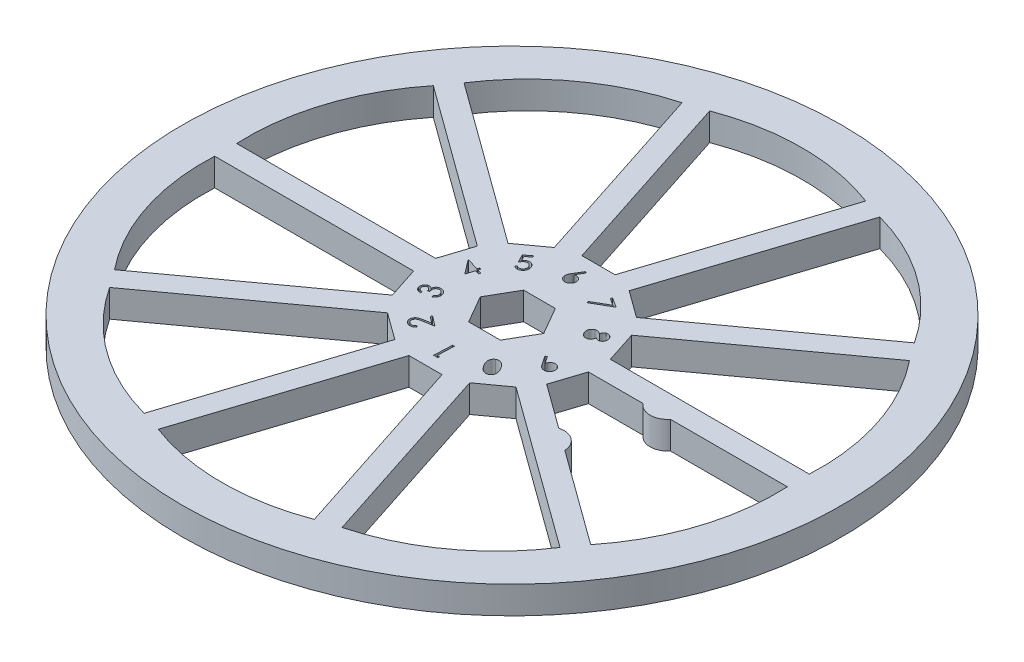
from build123d import *

# Parameters (mm, degrees)
SKETCH1_R           = 38.1
BOSS_EXTRUDE1_DEPTH = 3.175
CUT_EXTRUDE1_DEPTH  = 54.975
BOSS_EXTRUDE3_DEPTH = 3.175


with BuildPart() as part:
    # Sketch1 → Boss-Extrude1 (new body)
    with BuildSketch(Plane(origin=(0, 0, 0), x_dir=(1, 0, 0), z_dir=(0, 1, 0))):
        with Locations(Location((0, 0, 0), (0, 0, 270))):
            Circle(SKETCH1_R)
        with BuildLine():
            Line((-9.021230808, 31.874299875), (-1.913839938, 10))
            Line((-1.913839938, 10), (1.913839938, 10))
            Line((1.913839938, 10), (9.021230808, 31.874299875))
            ThreePointArc((9.021230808, 31.874299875), (0, 33.53030285), (-9.021230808, 31.874299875))
        make_face(mode=Mode.SUBTRACT)
        with BuildLine():
            Line((-4.329523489, 9.215096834), (-7.426181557, 6.965243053))
            Line((-7.426181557, 6.965243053), (-26.033572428, 20.484303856))
            ThreePointArc((-26.033572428, 20.484303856), (-19.70861752, 27.126584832), (-11.43691436, 31.089396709))
            Line((-11.43691436, 31.089396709), (-4.329523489, 9.215096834))
        make_face(mode=Mode.SUBTRACT)
        with BuildLine():
            Line((7.426181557, 6.965243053), (4.329523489, 9.215096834))
            Line((4.329523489, 9.215096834), (11.43691436, 31.089396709))
            ThreePointArc((11.43691436, 31.089396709), (19.70861752, 27.126584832), (26.033572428, 20.484303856))
            Line((26.033572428, 20.484303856), (7.426181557, 6.965243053))
        make_face(mode=Mode.SUBTRACT)
        with BuildLine():
            Line((-10.101974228, -1.27), (-8.919156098, -4.910339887))
            Line((-8.919156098, -4.910339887), (-27.526546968, -18.42940069))
            ThreePointArc((-27.526546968, -18.42940069), (-31.889213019, -10.361433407), (-33.101974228, -1.27))
            Line((-33.101974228, -1.27), (-10.101974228, -1.27))
        make_face(mode=Mode.SUBTRACT)
        with BuildLine():
            Line((8.919156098, -4.910339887), (10.101974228, -1.27))
            Line((10.101974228, -1.27), (33.101974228, -1.27))
            ThreePointArc((33.101974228, -1.27), (31.889213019, -10.361433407), (27.526546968, -18.42940069))
            Line((27.526546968, -18.42940069), (8.919156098, -4.910339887))
        make_face(mode=Mode.SUBTRACT)
        with BuildLine():
            Line((-1.913839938, -10), (1.913839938, -10))
            Line((1.913839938, -10), (9.021230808, -31.874299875))
            ThreePointArc((9.021230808, -31.874299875), (0, -33.53030285), (-9.021230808, -31.874299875))
            Line((-9.021230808, -31.874299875), (-1.913839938, -10))
        make_face(mode=Mode.SUBTRACT)
        with BuildLine():
            Line((-27.526546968, 18.42940069), (-8.919156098, 4.910339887))
            Line((-8.919156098, 4.910339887), (-10.101974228, 1.27))
            Line((-10.101974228, 1.27), (-33.101974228, 1.27))
            ThreePointArc((-33.101974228, 1.27), (-31.889213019, 10.361433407), (-27.526546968, 18.42940069))
        make_face(mode=Mode.SUBTRACT)
        with BuildLine():
            Line((-4.329523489, -9.215096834), (-7.426181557, -6.965243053))
            Line((-7.426181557, -6.965243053), (-26.033572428, -20.484303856))
            ThreePointArc((-26.033572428, -20.484303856), (-19.70861752, -27.126584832), (-11.43691436, -31.089396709))
            Line((-11.43691436, -31.089396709), (-4.329523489, -9.215096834))
        make_face(mode=Mode.SUBTRACT)
        with BuildLine():
            Line((8.919156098, 4.910339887), (10.101974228, 1.27))
            Line((10.101974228, 1.27), (33.101974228, 1.27))
            ThreePointArc((33.101974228, 1.27), (31.889213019, 10.361433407), (27.526546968, 18.42940069))
            Line((27.526546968, 18.42940069), (8.919156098, 4.910339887))
        make_face(mode=Mode.SUBTRACT)
        with BuildLine():
            Line((7.426181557, -6.965243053), (4.329523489, -9.215096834))
            Line((4.329523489, -9.215096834), (11.43691436, -31.089396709))
            ThreePointArc((11.43691436, -31.089396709), (19.70861752, -27.126584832), (26.033572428, -20.484303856))
            Line((26.033572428, -20.484303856), (7.426181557, -6.965243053))
        make_face(mode=Mode.SUBTRACT)
        Polygon((3.666174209, 0), (1.833087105, 3.175), (-1.833087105, 3.175), (-3.666174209, 0), (-1.833087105, -3.175), (1.833087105, -3.175), align=None, mode=Mode.SUBTRACT)
    extrude(amount=BOSS_EXTRUDE1_DEPTH)

    # Sketch4 → Cut-Extrude1 (cut, through all)
    # profile 1 of 10: a face of its own
    with BuildSketch(Plane(origin=(0, 3.175, 0), x_dir=(1, 0, 0), z_dir=(0, 1, 0))):
        with BuildLine():
            Line((6.008134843, -2.207274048), (6.177739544, -2.089822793))
            Line((6.177739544, -2.089822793), (6.758211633, -2.944630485))
            add(Edge.make_bspline(
                [(6.758211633, -2.944630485), (6.759998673, -2.925079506), (6.763474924, -2.887047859), (6.774121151, -2.832025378), (6.787033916, -2.780153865), (6.79957908, -2.747641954), (6.805700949, -2.731776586)],
                knots=[0, 0, 0, 0, 1.075315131, 2.091762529, 3.068806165, 4, 4, 4, 4], degree=3))
            add(Edge.make_bspline(
                [(6.805700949, -2.731776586), (6.814114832, -2.712946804), (6.830622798, -2.676002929), (6.861067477, -2.624206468), (6.895968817, -2.576829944), (6.93547794, -2.534024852), (6.979105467, -2.495536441), (7.026933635, -2.461337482), (7.079339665, -2.431783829), (7.135292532, -2.406331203), (7.193818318, -2.386944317), (7.25294362, -2.371809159), (7.312752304, -2.364676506), (7.37280331, -2.362097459), (7.433253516, -2.366845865), (7.494165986, -2.376191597), (7.555058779, -2.393146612), (7.594897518, -2.408226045), (7.615139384, -2.41588783)],
                knots=[0, 0, 0, 0, 1.022013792, 2.005182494, 2.97231041, 3.934474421, 4.887767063, 5.852327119, 6.844124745, 7.866642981, 8.894932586, 9.89776092, 10.886955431, 11.875703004, 12.873302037, 13.888324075, 14.92706791, 16, 16, 16, 16], degree=3))
            add(Edge.make_bspline(
                [(7.615139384, -2.41588783), (7.642252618, -2.427997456), (7.69550017, -2.451779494), (7.767460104, -2.499863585), (7.831918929, -2.554778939), (7.887467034, -2.617883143), (7.9344972, -2.68733619), (7.970479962, -2.763279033), (7.997382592, -2.844220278), (8.01225277, -2.929759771), (8.018329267, -3.017010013), (8.011970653, -3.103897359), (7.99559219, -3.18956788), (7.975215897, -3.244078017), (7.96494908, -3.271543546)],
                knots=[0, 0, 0, 0, 1.036517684, 2.035612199, 3.013201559, 3.989841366, 4.965618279, 5.935849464, 6.918719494, 7.938327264, 8.963189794, 9.968654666, 10.976484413, 12, 12, 12, 12], degree=3))
            add(Edge.make_bspline(
                [(7.96494908, -3.271543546), (7.953007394, -3.297601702), (7.929392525, -3.349132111), (7.883005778, -3.42015218), (7.827837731, -3.483771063), (7.764704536, -3.539697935), (7.695005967, -3.58667744), (7.619724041, -3.623714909), (7.539702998, -3.650143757), (7.455893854, -3.665037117), (7.370871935, -3.669755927), (7.286493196, -3.663939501), (7.203629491, -3.64695365), (7.150782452, -3.627680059), (7.124133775, -3.617961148)],
                knots=[0, 0, 0, 0, 1.01839986, 2.013901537, 3.004594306, 4.005222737, 5.004853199, 5.985019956, 6.980115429, 7.991731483, 9.003622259, 10.001405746, 10.99218778, 12, 12, 12, 12], degree=3))
            add(Edge.make_bspline(
                [(7.124133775, -3.617961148), (7.103996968, -3.609044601), (7.063097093, -3.590934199), (7.004458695, -3.55542633), (6.946830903, -3.513795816), (6.889198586, -3.464959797), (6.831284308, -3.406042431), (6.771386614, -3.335849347), (6.708385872, -3.253625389), (6.667446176, -3.193463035), (6.645848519, -3.161724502)],
                knots=[0, 0, 0, 0, 0.787036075, 1.59854923, 2.445988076, 3.328266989, 4.297018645, 5.397528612, 6.627071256, 8, 8, 8, 8], degree=3))
            Line((6.645848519, -3.161724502), (6.008134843, -2.207274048))
        make_face()
        with BuildLine():
            add(Edge.make_bspline(
                [(6.95834518, -2.847107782), (6.952989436, -2.861294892), (6.942472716, -2.889153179), (6.931447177, -2.932053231), (6.924479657, -2.974773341), (6.922503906, -3.017701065), (6.924432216, -3.060493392), (6.931469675, -3.103213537), (6.942557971, -3.145787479), (6.957709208, -3.187807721), (6.976574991, -3.22836067), (6.99915169, -3.265942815), (7.024219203, -3.300999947), (7.053299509, -3.332077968), (7.084809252, -3.360938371), (7.119674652, -3.386315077), (7.1576361, -3.408574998), (7.184642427, -3.420622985), (7.198335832, -3.426731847)],
                knots=[0, 0, 0, 0, 1.04241003, 2.04691155, 3.041056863, 4.014450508, 4.997553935, 5.98209837, 6.98659989, 8.019857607, 9.050596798, 10.057635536, 11.031854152, 12.008882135, 12.979358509, 13.967161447, 14.969260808, 16, 16, 16, 16], degree=3))
            add(Edge.make_bspline(
                [(7.198335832, -3.426731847), (7.212380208, -3.432084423), (7.240078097, -3.442640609), (7.282683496, -3.453715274), (7.325332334, -3.460060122), (7.367935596, -3.462185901), (7.410590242, -3.460186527), (7.453169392, -3.453186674), (7.495742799, -3.442093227), (7.537766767, -3.42694772), (7.578305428, -3.408064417), (7.616108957, -3.385448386), (7.651210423, -3.359957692), (7.683006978, -3.331063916), (7.711642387, -3.299131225), (7.736716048, -3.263819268), (7.759464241, -3.2258657), (7.771465, -3.198476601), (7.777535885, -3.184621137)],
                knots=[0, 0, 0, 0, 1.032325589, 2.035920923, 3.01808944, 3.990604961, 4.963120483, 5.946776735, 6.950372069, 7.982697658, 9.012506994, 10.018637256, 11.005549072, 11.988869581, 12.965692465, 13.946899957, 14.96138774, 16, 16, 16, 16], degree=3))
            add(Edge.make_bspline(
                [(7.777535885, -3.184621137), (7.782888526, -3.170576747), (7.793444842, -3.142878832), (7.804518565, -3.100273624), (7.810866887, -3.057624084), (7.81297986, -3.015023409), (7.811034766, -2.972498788), (7.803901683, -2.930091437), (7.793020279, -2.887543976), (7.777216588, -2.84570235), (7.758450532, -2.805086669), (7.73598684, -2.767285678), (7.710138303, -2.73274507), (7.682067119, -2.700591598), (7.649609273, -2.672704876), (7.614988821, -2.647052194), (7.576958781, -2.624864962), (7.549961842, -2.612807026), (7.536273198, -2.606693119)],
                knots=[0, 0, 0, 0, 1.035134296, 2.041460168, 3.026300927, 4.001462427, 4.976623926, 5.953340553, 6.959666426, 7.998140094, 9.030751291, 10.039618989, 11.021372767, 12.000853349, 12.97387249, 13.963469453, 14.967388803, 16, 16, 16, 16], degree=3))
            add(Edge.make_bspline(
                [(7.536273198, -2.606693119), (7.522228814, -2.601340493), (7.494530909, -2.590784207), (7.451925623, -2.579710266), (7.40927637, -2.573362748), (7.366674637, -2.571246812), (7.324153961, -2.573202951), (7.281731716, -2.580294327), (7.239289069, -2.591325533), (7.197267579, -2.606480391), (7.156723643, -2.625354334), (7.119107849, -2.647895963), (7.084249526, -2.673035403), (7.05270375, -2.701635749), (7.024303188, -2.733592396), (6.998734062, -2.768420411), (6.976509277, -2.806414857), (6.964456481, -2.833416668), (6.95834518, -2.847107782)],
                knots=[0, 0, 0, 0, 1.035774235, 2.042722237, 3.028171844, 4.003936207, 4.97970057, 5.957021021, 6.963969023, 7.999743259, 9.032992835, 10.042484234, 11.019075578, 11.991915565, 12.972001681, 13.962210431, 14.966750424, 16, 16, 16, 16], degree=3))
        make_face(mode=Mode.SUBTRACT)
    # profile 2 of 10: a face of its own
    with BuildSketch(Plane(origin=(0, 3.175, 0), x_dir=(1, 0, 0), z_dir=(0, 1, 0))):
        with BuildLine():
            add(Edge.make_bspline(
                [(4.646652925, -5.931807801), (4.664653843, -5.960382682), (4.699634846, -6.015911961), (4.747354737, -6.098619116), (4.790166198, -6.177405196), (4.826609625, -6.253248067), (4.858252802, -6.325337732), (4.883533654, -6.394290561), (4.904552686, -6.459292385), (4.918854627, -6.521510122), (4.928559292, -6.581183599), (4.935235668, -6.638614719), (4.93732577, -6.694605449), (4.935504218, -6.74883383), (4.930801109, -6.801640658), (4.921102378, -6.85256161), (4.908739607, -6.902089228), (4.891437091, -6.949348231), (4.871669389, -6.994993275), (4.848359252, -7.037995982), (4.822277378, -7.078671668), (4.793328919, -7.117034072), (4.761282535, -7.153082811), (4.725658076, -7.186019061), (4.688011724, -7.2175363), (4.660548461, -7.235754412), (4.646652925, -7.244972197)],
                knots=[0, 0, 0, 0, 1.645831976, 3.198328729, 4.653025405, 6.014789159, 7.298288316, 8.488304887, 9.592894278, 10.625525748, 11.596046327, 12.538562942, 13.441613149, 14.323771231, 15.181935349, 16.02233202, 16.84768784, 17.666926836, 18.471967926, 19.270231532, 20.04793037, 20.824957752, 21.610397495, 22.394990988, 23.187916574, 24, 24, 24, 24], degree=3))
            add(Edge.make_bspline(
                [(4.646652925, -7.244972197), (4.632210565, -7.253659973), (4.603571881, -7.270887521), (4.558936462, -7.292877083), (4.513552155, -7.31141686), (4.46682123, -7.325096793), (4.419388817, -7.336574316), (4.370656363, -7.343114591), (4.321058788, -7.345990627), (4.270734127, -7.345775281), (4.219812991, -7.341051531), (4.168660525, -7.331997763), (4.117234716, -7.318998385), (4.065880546, -7.300751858), (4.014072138, -7.279250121), (3.96212162, -7.253337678), (3.910543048, -7.222396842), (3.858035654, -7.188211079), (3.805463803, -7.14844253), (3.753195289, -7.102535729), (3.700437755, -7.051113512), (3.647904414, -6.993565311), (3.594917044, -6.93028461), (3.541542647, -6.861156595), (3.488038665, -6.78607171), (3.453708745, -6.733182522), (3.436099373, -6.70605326)],
                knots=[0, 0, 0, 0, 0.815853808, 1.617808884, 2.407075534, 3.186547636, 3.973496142, 4.768174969, 5.563560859, 6.378064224, 7.202826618, 8.036627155, 8.8915378, 9.768172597, 10.673203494, 11.606770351, 12.576348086, 13.584347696, 14.639750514, 15.765220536, 16.951028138, 18.2056322, 19.536778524, 20.946858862, 22.433905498, 24, 24, 24, 24], degree=3))
            add(Edge.make_bspline(
                [(3.436099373, -6.70605326), (3.418942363, -6.678753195), (3.385580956, -6.625668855), (3.340039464, -6.546033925), (3.299818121, -6.469043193), (3.264567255, -6.394803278), (3.233984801, -6.323432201), (3.209598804, -6.254353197), (3.189676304, -6.188096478), (3.175613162, -6.124127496), (3.166580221, -6.062444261), (3.160134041, -6.002902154), (3.15878161, -5.94509298), (3.160059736, -5.889115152), (3.166132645, -5.834970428), (3.176008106, -5.782742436), (3.188897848, -5.73196885), (3.20648032, -5.683324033), (3.227187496, -5.636704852), (3.250926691, -5.592663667), (3.27741237, -5.551018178), (3.307112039, -5.512065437), (3.339870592, -5.475496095), (3.375483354, -5.441471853), (3.414374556, -5.410343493), (3.442041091, -5.391709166), (3.456027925, -5.38228857)],
                knots=[0, 0, 0, 0, 1.562310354, 3.03787612, 4.44395277, 5.770467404, 7.019601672, 8.204525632, 9.318421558, 10.370311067, 11.374754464, 12.338370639, 13.270212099, 14.174670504, 15.049738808, 15.906744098, 16.748953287, 17.585125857, 18.409860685, 19.218832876, 20.007279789, 20.799021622, 21.589607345, 22.384069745, 23.183065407, 24, 24, 24, 24], degree=3))
            add(Edge.make_bspline(
                [(3.456027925, -5.38228857), (3.470162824, -5.373559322), (3.498234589, -5.356223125), (3.542375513, -5.334858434), (3.587289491, -5.316873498), (3.632845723, -5.302304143), (3.679602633, -5.292260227), (3.727050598, -5.285345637), (3.775552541, -5.282429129), (3.824739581, -5.283313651), (3.874519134, -5.287940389), (3.924474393, -5.296773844), (3.974358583, -5.310326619), (4.024511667, -5.32689591), (4.074164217, -5.349154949), (4.124478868, -5.374302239), (4.174255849, -5.404791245), (4.224911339, -5.43875031), (4.275625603, -5.478577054), (4.326757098, -5.524445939), (4.37876556, -5.57648179), (4.43112742, -5.635168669), (4.484587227, -5.699994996), (4.538287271, -5.771525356), (4.593131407, -5.848985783), (4.628480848, -5.903687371), (4.646652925, -5.931807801)],
                knots=[0, 0, 0, 0, 0.810485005, 1.609614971, 2.389818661, 3.17096737, 3.9409775, 4.72151665, 5.509490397, 6.3098999, 7.120649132, 7.947529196, 8.782571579, 9.642161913, 10.522704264, 11.435989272, 12.386082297, 13.369627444, 14.411590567, 15.530535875, 16.720858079, 18.000814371, 19.368238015, 20.821189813, 22.365869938, 24, 24, 24, 24], degree=3))
        make_face()
        with BuildLine():
            add(Edge.make_bspline(
                [(4.477048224, -6.03569068), (4.461336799, -6.011584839), (4.430874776, -5.964847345), (4.384673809, -5.898223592), (4.339654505, -5.837300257), (4.296712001, -5.781252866), (4.253866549, -5.731915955), (4.212529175, -5.687959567), (4.172992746, -5.649190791), (4.122303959, -5.606353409), (4.059293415, -5.562604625), (3.982412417, -5.521661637), (3.904429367, -5.494758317), (3.826538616, -5.482243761), (3.751238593, -5.481369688), (3.679737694, -5.490796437), (3.612804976, -5.511945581), (3.572716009, -5.534631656), (3.552702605, -5.545957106)],
                knots=[0, 0, 0, 0, 1.181714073, 2.291160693, 3.329086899, 4.292828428, 5.190029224, 6.011310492, 6.770753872, 7.462710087, 8.734792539, 9.913537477, 11.029615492, 12.106059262, 13.139365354, 14.112154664, 15.057540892, 16, 16, 16, 16], degree=3))
            add(Edge.make_bspline(
                [(3.552702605, -5.545957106), (3.533742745, -5.559266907), (3.495894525, -5.585836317), (3.449291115, -5.638313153), (3.409655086, -5.697727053), (3.3845157, -5.753620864), (3.369314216, -5.801765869), (3.360967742, -5.839948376), (3.355245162, -5.879484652), (3.353557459, -5.920474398), (3.353474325, -5.96287331), (3.35839661, -6.006697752), (3.36469003, -6.052122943), (3.371826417, -6.082519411), (3.375465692, -6.098020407)],
                knots=[0, 0, 0, 0, 1.339326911, 2.673603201, 4.03984646, 5.470463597, 6.209276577, 6.964946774, 7.734622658, 8.522543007, 9.342223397, 10.190421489, 11.077186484, 12, 12, 12, 12], degree=3))
            add(Edge.make_bspline(
                [(3.375465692, -6.098020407), (3.380323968, -6.117589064), (3.390191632, -6.157335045), (3.409612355, -6.216842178), (3.432615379, -6.277443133), (3.458868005, -6.339282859), (3.488677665, -6.402245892), (3.522143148, -6.466212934), (3.559602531, -6.531121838), (3.586495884, -6.574263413), (3.600191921, -6.596234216)],
                knots=[0, 0, 0, 0, 0.881068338, 1.78954166, 2.733856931, 3.713774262, 4.725199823, 5.77800347, 6.868398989, 8, 8, 8, 8], degree=3))
            add(Edge.make_bspline(
                [(3.600191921, -6.596234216), (3.614348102, -6.617938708), (3.64197834, -6.660301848), (3.684447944, -6.721027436), (3.726719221, -6.777700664), (3.769667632, -6.829461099), (3.811504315, -6.877946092), (3.854128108, -6.921512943), (3.896182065, -6.961411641), (3.938483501, -6.996813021), (3.980402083, -7.028214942), (4.021929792, -7.05574057), (4.062824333, -7.079839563), (4.103521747, -7.099803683), (4.14398596, -7.115877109), (4.183669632, -7.128911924), (4.223215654, -7.13732462), (4.274252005, -7.144086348), (4.336254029, -7.144204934), (4.407123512, -7.134105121), (4.473771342, -7.113837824), (4.513310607, -7.090993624), (4.533017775, -7.079607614)],
                knots=[0, 0, 0, 0, 1.330078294, 2.596065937, 3.80331419, 4.957991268, 6.047946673, 7.089475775, 8.085195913, 9.022479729, 9.919210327, 10.772385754, 11.578713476, 12.354194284, 13.096521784, 13.81239025, 14.49544863, 15.168571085, 16.45274294, 17.662430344, 18.834908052, 20, 20, 20, 20], degree=3))
            add(Edge.make_bspline(
                [(4.533017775, -7.079607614), (4.551939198, -7.066264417), (4.589789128, -7.039573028), (4.637042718, -6.987472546), (4.67612162, -6.927149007), (4.70103527, -6.870696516), (4.716800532, -6.822117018), (4.725744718, -6.78368549), (4.731007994, -6.74378164), (4.734255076, -6.702717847), (4.733538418, -6.660196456), (4.730294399, -6.616254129), (4.723186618, -6.571169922), (4.713968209, -6.524204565), (4.700519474, -6.474910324), (4.68273882, -6.422299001), (4.659460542, -6.366514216), (4.632391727, -6.307004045), (4.60027979, -6.244212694), (4.563955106, -6.177582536), (4.522113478, -6.107775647), (4.492391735, -6.060233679), (4.477048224, -6.03569068)],
                knots=[0, 0, 0, 0, 1.185349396, 2.371142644, 3.582401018, 4.861775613, 5.524760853, 6.202231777, 6.88342084, 7.58889689, 8.314341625, 9.063762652, 9.848579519, 10.655219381, 11.519217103, 12.46892058, 13.503486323, 14.620144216, 15.823732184, 17.122294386, 18.514417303, 20, 20, 20, 20], degree=3))
        make_face(mode=Mode.SUBTRACT)
    # profile 3 of 10: a face of its own
    with BuildSketch(Plane(origin=(0, 3.175, 0), x_dir=(1, 0, 0), z_dir=(0, 1, 0))):
        Polygon((-0.096389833, -8.560304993), (-0.510225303, -8.542920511), (-0.421606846, -6.437702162), (-0.212569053, -6.446606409), (-0.292283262, -8.345755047), (0.038445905, -8.359747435), align=None)
    # profile 4 of 10: a face of its own
    with BuildSketch(Plane(origin=(0, 3.175, 0), x_dir=(1, 0, 0), z_dir=(0, 1, 0))):
        with BuildLine():
            Line((-4.432784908, -6.555224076), (-4.272084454, -6.678611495))
            add(Edge.make_bspline(
                [(-4.272084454, -6.678611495), (-4.288747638, -6.698101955), (-4.32139403, -6.736287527), (-4.374584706, -6.788037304), (-4.430999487, -6.832573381), (-4.489513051, -6.871705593), (-4.551289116, -6.903333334), (-4.615371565, -6.929164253), (-4.682189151, -6.948162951), (-4.750905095, -6.960833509), (-4.820208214, -6.966758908), (-4.888667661, -6.965995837), (-4.955750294, -6.958369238), (-5.021160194, -6.943747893), (-5.085314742, -6.923145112), (-5.147303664, -6.894517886), (-5.208611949, -6.86039639), (-5.246882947, -6.832388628), (-5.266392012, -6.818111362)],
                knots=[0, 0, 0, 0, 1.100149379, 2.155404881, 3.178494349, 4.181169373, 5.171382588, 6.151324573, 7.141983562, 8.147297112, 9.145688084, 10.122339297, 11.080890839, 12.037502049, 12.994670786, 13.966544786, 14.963423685, 16, 16, 16, 16], degree=3))
            add(Edge.make_bspline(
                [(-5.266392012, -6.818111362), (-5.284896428, -6.803157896), (-5.321055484, -6.773937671), (-5.36973623, -6.725642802), (-5.41205071, -6.674813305), (-5.447107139, -6.620795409), (-5.477525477, -6.565190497), (-5.5001583, -6.506349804), (-5.517019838, -6.44515282), (-5.526781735, -6.381980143), (-5.531141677, -6.318543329), (-5.52931742, -6.256102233), (-5.5223844, -6.195408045), (-5.508956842, -6.136542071), (-5.490389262, -6.079329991), (-5.465435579, -6.02412847), (-5.435477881, -5.970182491), (-5.411061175, -5.936636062), (-5.398683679, -5.919630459)],
                knots=[0, 0, 0, 0, 1.125548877, 2.199409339, 3.240166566, 4.24957425, 5.243251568, 6.234651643, 7.22627742, 8.242556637, 9.254974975, 10.232096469, 11.195517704, 12.141759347, 13.085324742, 14.03767207, 15.005242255, 16, 16, 16, 16], degree=3))
            add(Edge.make_bspline(
                [(-5.398683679, -5.919630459), (-5.379898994, -5.89676072), (-5.342666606, -5.851431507), (-5.276831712, -5.79317008), (-5.204684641, -5.743522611), (-5.138403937, -5.709613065), (-5.079785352, -5.686256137), (-5.029446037, -5.668512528), (-4.972972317, -5.651252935), (-4.910475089, -5.634266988), (-4.841680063, -5.617935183), (-4.766795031, -5.601372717), (-4.685785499, -5.585283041), (-4.629687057, -5.575368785), (-4.600693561, -5.570244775)],
                knots=[0, 0, 0, 0, 1.19032024, 2.359287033, 3.526020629, 4.709749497, 5.348159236, 6.06644772, 6.858627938, 7.725764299, 8.674200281, 9.705837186, 10.814302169, 12, 12, 12, 12], degree=3))
            Line((-4.600693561, -5.570244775), (-3.838320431, -5.440497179))
            Line((-3.838320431, -5.440497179), (-4.612141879, -4.846880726))
            Line((-4.612141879, -4.846880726), (-4.487906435, -4.684908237))
            Line((-4.487906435, -4.684908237), (-3.349434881, -5.558372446))
            Line((-3.349434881, -5.558372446), (-4.520131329, -5.758930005))
            add(Edge.make_bspline(
                [(-4.520131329, -5.758930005), (-4.54854643, -5.763840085), (-4.603295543, -5.773300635), (-4.681952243, -5.787498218), (-4.753765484, -5.801920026), (-4.818661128, -5.816297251), (-4.876698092, -5.830478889), (-4.927777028, -5.845129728), (-4.972237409, -5.85869336), (-5.021781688, -5.877197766), (-5.076562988, -5.903509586), (-5.135683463, -5.942107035), (-5.188994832, -5.987325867), (-5.218547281, -6.023044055), (-5.233319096, -6.04089782)],
                knots=[0, 0, 0, 0, 1.320310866, 2.543923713, 3.659492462, 4.673759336, 5.587226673, 6.394355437, 7.106613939, 7.714816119, 8.814657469, 9.880838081, 10.940735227, 12, 12, 12, 12], degree=3))
            add(Edge.make_bspline(
                [(-5.233319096, -6.04089782), (-5.24191783, -6.052743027), (-5.258886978, -6.076118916), (-5.279576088, -6.113751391), (-5.296491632, -6.152399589), (-5.30798111, -6.19271991), (-5.316947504, -6.23386884), (-5.320508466, -6.276718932), (-5.320067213, -6.320719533), (-5.315427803, -6.365447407), (-5.306532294, -6.409713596), (-5.293858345, -6.452610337), (-5.277385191, -6.493450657), (-5.256611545, -6.53213664), (-5.232226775, -6.568919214), (-5.203475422, -6.603398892), (-5.171065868, -6.636025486), (-5.146876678, -6.655514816), (-5.134524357, -6.665467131)],
                knots=[0, 0, 0, 0, 0.998093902, 1.969685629, 2.92471149, 3.87082952, 4.826196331, 5.794718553, 6.797973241, 7.825964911, 8.85887793, 9.875217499, 10.874755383, 11.858671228, 12.867290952, 13.881293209, 14.918072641, 16, 16, 16, 16], degree=3))
            add(Edge.make_bspline(
                [(-5.134524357, -6.665467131), (-5.121107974, -6.675161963), (-5.094698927, -6.694245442), (-5.053115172, -6.718546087), (-5.010432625, -6.73776632), (-4.966903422, -6.75212129), (-4.922690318, -6.76268893), (-4.877420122, -6.76741431), (-4.831406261, -6.768583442), (-4.784821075, -6.764074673), (-4.73803111, -6.755305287), (-4.691880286, -6.741237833), (-4.646557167, -6.722265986), (-4.601867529, -6.698948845), (-4.558038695, -6.670349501), (-4.515307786, -6.636456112), (-4.47258305, -6.598563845), (-4.44624936, -6.569886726), (-4.432784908, -6.555224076)],
                knots=[0, 0, 0, 0, 1.00430334, 1.976888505, 2.917624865, 3.839993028, 4.755634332, 5.670793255, 6.597460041, 7.54501695, 8.505725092, 9.482726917, 10.467307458, 11.484173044, 12.538281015, 13.638306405, 14.792462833, 16, 16, 16, 16], degree=3))
        make_face()
    # profile 5 of 10: a face of its own
    with BuildSketch(Plane(origin=(0, 3.175, 0), x_dir=(1, 0, 0), z_dir=(0, 1, 0))):
        with BuildLine():
            Line((-7.565496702, -2.829563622), (-7.501046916, -3.034361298))
            add(Edge.make_bspline(
                [(-7.501046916, -3.034361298), (-7.522803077, -3.035798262), (-7.565300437, -3.038605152), (-7.628067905, -3.03757569), (-7.688355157, -3.032805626), (-7.745989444, -3.022842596), (-7.801252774, -3.009392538), (-7.853891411, -2.991307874), (-7.903674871, -2.967944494), (-7.951144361, -2.9415616), (-7.99528649, -2.910998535), (-8.035671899, -2.876848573), (-8.072717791, -2.839848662), (-8.106327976, -2.799938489), (-8.136296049, -2.756865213), (-8.161942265, -2.710366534), (-8.184891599, -2.661079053), (-8.196478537, -2.626309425), (-8.202362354, -2.608653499)],
                knots=[0, 0, 0, 0, 1.171238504, 2.287836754, 3.370199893, 4.417814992, 5.427291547, 6.424116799, 7.402837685, 8.378843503, 9.339569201, 10.28287391, 11.217361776, 12.149964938, 13.083310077, 14.032011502, 15.000660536, 16, 16, 16, 16], degree=3))
            add(Edge.make_bspline(
                [(-8.202362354, -2.608653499), (-8.209664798, -2.582652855), (-8.224142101, -2.531105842), (-8.23413508, -2.451641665), (-8.233967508, -2.372208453), (-8.224755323, -2.29361638), (-8.206374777, -2.21760588), (-8.178727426, -2.146289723), (-8.142316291, -2.080673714), (-8.097802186, -2.021474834), (-8.04692814, -1.969471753), (-7.990648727, -1.926352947), (-7.930693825, -1.890920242), (-7.887340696, -1.875568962), (-7.865697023, -1.867904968)],
                knots=[0, 0, 0, 0, 1.075905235, 2.133012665, 3.181428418, 4.237152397, 5.28162113, 6.291729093, 7.278286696, 8.264699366, 9.23724505, 10.169628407, 11.086202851, 12, 12, 12, 12], degree=3))
            add(Edge.make_bspline(
                [(-7.865697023, -1.867904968), (-7.844348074, -1.86189963), (-7.802444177, -1.850112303), (-7.738057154, -1.843513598), (-7.674676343, -1.846053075), (-7.612164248, -1.857698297), (-7.550478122, -1.878280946), (-7.489908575, -1.908495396), (-7.4301808, -1.947739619), (-7.393010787, -1.979551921), (-7.37384339, -1.995956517)],
                knots=[0, 0, 0, 0, 0.994688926, 1.952383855, 2.892751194, 3.835366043, 4.799018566, 5.804107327, 6.867647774, 8, 8, 8, 8], degree=3))
            add(Edge.make_bspline(
                [(-7.37384339, -1.995956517), (-7.370852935, -1.96940386), (-7.364961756, -1.917095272), (-7.344384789, -1.84154662), (-7.315929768, -1.769821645), (-7.289527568, -1.726104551), (-7.276320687, -1.704236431)],
                knots=[0, 0, 0, 0, 1.030676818, 2.03042766, 3.01478259, 4, 4, 4, 4], degree=3))
            add(Edge.make_bspline(
                [(-7.276320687, -1.704236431), (-7.266402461, -1.689627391), (-7.246729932, -1.66065076), (-7.213048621, -1.621061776), (-7.177397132, -1.584679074), (-7.139072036, -1.552304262), (-7.098083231, -1.523821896), (-7.054765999, -1.498709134), (-7.008826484, -1.477251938), (-6.976658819, -1.466352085), (-6.960431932, -1.460853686)],
                knots=[0, 0, 0, 0, 1.040428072, 2.063660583, 3.05951573, 4.04114841, 5.016713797, 5.99866477, 6.990432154, 8, 8, 8, 8], degree=3))
            add(Edge.make_bspline(
                [(-6.960431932, -1.460853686), (-6.931915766, -1.452902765), (-6.875020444, -1.437039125), (-6.786322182, -1.429060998), (-6.696394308, -1.431178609), (-6.621444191, -1.444052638), (-6.561839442, -1.459014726), (-6.518146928, -1.473369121), (-6.476073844, -1.490988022), (-6.4354331, -1.510696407), (-6.39649166, -1.533426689), (-6.359274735, -1.558845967), (-6.323412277, -1.587011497), (-6.277867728, -1.628129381), (-6.22556827, -1.685355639), (-6.171884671, -1.762298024), (-6.1270562, -1.847277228), (-6.105830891, -1.908427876), (-6.095023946, -1.939562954)],
                knots=[0, 0, 0, 0, 1.287151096, 2.568117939, 3.861540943, 5.196567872, 5.870010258, 6.537800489, 7.197510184, 7.855580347, 8.503930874, 9.159664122, 9.817359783, 10.488688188, 11.830921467, 13.183647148, 14.566043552, 16, 16, 16, 16], degree=3))
            add(Edge.make_bspline(
                [(-6.095023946, -1.939562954), (-6.088674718, -1.960803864), (-6.076183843, -2.002591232), (-6.064823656, -2.066015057), (-6.057478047, -2.127913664), (-6.056998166, -2.18880699), (-6.06076195, -2.248488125), (-6.071373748, -2.306878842), (-6.086464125, -2.364228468), (-6.10784562, -2.419893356), (-6.134045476, -2.474245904), (-6.166565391, -2.525817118), (-6.203934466, -2.575533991), (-6.247662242, -2.621960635), (-6.296054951, -2.666905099), (-6.350625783, -2.708695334), (-6.410598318, -2.748323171), (-6.453425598, -2.77204409), (-6.475362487, -2.784194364)],
                knots=[0, 0, 0, 0, 1.044301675, 2.054460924, 3.033078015, 3.979313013, 4.921150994, 5.847878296, 6.772375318, 7.712868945, 8.654518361, 9.612225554, 10.582368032, 11.581901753, 12.614575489, 13.692761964, 14.818191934, 16, 16, 16, 16], degree=3))
            Line((-6.475362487, -2.784194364), (-6.537268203, -2.587876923))
            add(Edge.make_bspline(
                [(-6.537268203, -2.587876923), (-6.522873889, -2.578581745), (-6.494821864, -2.560467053), (-6.456017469, -2.531244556), (-6.421114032, -2.501734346), (-6.389324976, -2.472646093), (-6.361927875, -2.442498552), (-6.337925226, -2.412323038), (-6.317655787, -2.381777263), (-6.3071027, -2.360440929), (-6.301941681, -2.35000633)],
                knots=[0, 0, 0, 0, 1.212756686, 2.36345273, 3.435782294, 4.448175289, 5.411358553, 6.316173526, 7.176519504, 8, 8, 8, 8], degree=3))
            add(Edge.make_bspline(
                [(-6.301941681, -2.35000633), (-6.296462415, -2.336670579), (-6.28555712, -2.310128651), (-6.273645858, -2.268667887), (-6.265995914, -2.226050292), (-6.26261346, -2.182297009), (-6.263633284, -2.13760073), (-6.268306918, -2.091924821), (-6.277127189, -2.045208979), (-6.286264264, -2.014261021), (-6.290917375, -1.998500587)],
                knots=[0, 0, 0, 0, 0.961111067, 1.912883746, 2.87075297, 3.844677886, 4.834712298, 5.848737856, 6.904456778, 8, 8, 8, 8], degree=3))
            add(Edge.make_bspline(
                [(-6.290917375, -1.998500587), (-6.297010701, -1.980873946), (-6.308933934, -1.946382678), (-6.33094473, -1.897432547), (-6.356588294, -1.852719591), (-6.385032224, -1.811670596), (-6.416862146, -1.774563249), (-6.45240474, -1.741729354), (-6.491009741, -1.712796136), (-6.532537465, -1.688372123), (-6.575540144, -1.668288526), (-6.618837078, -1.651918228), (-6.662438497, -1.640329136), (-6.706212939, -1.633522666), (-6.75013484, -1.631366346), (-6.794047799, -1.633956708), (-6.838079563, -1.641202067), (-6.866931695, -1.649265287), (-6.881565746, -1.653355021)],
                knots=[0, 0, 0, 0, 1.171811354, 2.29296428, 3.367246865, 4.407191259, 5.427563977, 6.433292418, 7.442428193, 8.454024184, 9.455427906, 10.422353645, 11.359649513, 12.285595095, 13.201644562, 14.118167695, 15.045518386, 16, 16, 16, 16], degree=3))
            add(Edge.make_bspline(
                [(-6.881565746, -1.653355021), (-6.900613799, -1.660284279), (-6.93855689, -1.674087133), (-6.99106043, -1.704852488), (-7.039036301, -1.742954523), (-7.081544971, -1.788225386), (-7.117905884, -1.838969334), (-7.147299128, -1.893988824), (-7.167372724, -1.953208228), (-7.178406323, -2.005141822), (-7.1823192, -2.049742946), (-7.18245454, -2.086854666), (-7.180835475, -2.127341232), (-7.17641199, -2.171197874), (-7.16958548, -2.218578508), (-7.160248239, -2.269356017), (-7.148150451, -2.323432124), (-7.139012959, -2.360482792), (-7.13427675, -2.379687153)],
                knots=[0, 0, 0, 0, 1.125656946, 2.242271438, 3.367021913, 4.523877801, 5.68462785, 6.831151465, 7.979910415, 9.151790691, 9.775346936, 10.467275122, 11.214856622, 12.028482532, 12.918001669, 13.877203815, 14.899697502, 16, 16, 16, 16], degree=3))
            Line((-7.13427675, -2.379687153), (-7.318297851, -2.437776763))
            add(Edge.make_bspline(
                [(-7.318297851, -2.437776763), (-7.325865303, -2.415390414), (-7.34072771, -2.371423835), (-7.370986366, -2.309937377), (-7.405148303, -2.252846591), (-7.444867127, -2.20226408), (-7.48675449, -2.157952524), (-7.529923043, -2.121084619), (-7.574943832, -2.094155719), (-7.620407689, -2.075384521), (-7.666229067, -2.065353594), (-7.711743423, -2.061881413), (-7.757239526, -2.064874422), (-7.786503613, -2.072899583), (-7.801247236, -2.076942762)],
                knots=[0, 0, 0, 0, 1.267118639, 2.488609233, 3.669981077, 4.832371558, 5.932386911, 6.939653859, 7.868597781, 8.736393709, 9.568297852, 10.374733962, 11.181170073, 12, 12, 12, 12], degree=3))
            add(Edge.make_bspline(
                [(-7.801247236, -2.076942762), (-7.811932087, -2.08068524), (-7.832883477, -2.08802368), (-7.862707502, -2.102681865), (-7.890053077, -2.120627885), (-7.915992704, -2.140848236), (-7.938630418, -2.165117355), (-7.960206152, -2.191223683), (-7.978699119, -2.220987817), (-7.995565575, -2.252740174), (-8.009700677, -2.286571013), (-8.01966591, -2.321781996), (-8.026558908, -2.357535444), (-8.029930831, -2.394021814), (-8.030034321, -2.431377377), (-8.025970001, -2.469514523), (-8.018947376, -2.508470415), (-8.011247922, -2.534091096), (-8.007316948, -2.547171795)],
                knots=[0, 0, 0, 0, 0.950376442, 1.86354576, 2.782254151, 3.694419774, 4.617947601, 5.563492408, 6.534987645, 7.5545434, 8.581879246, 9.607567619, 10.622690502, 11.636215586, 12.680895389, 13.754646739, 14.853629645, 16, 16, 16, 16], degree=3))
            add(Edge.make_bspline(
                [(-8.007316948, -2.547171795), (-7.999961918, -2.567841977), (-7.985578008, -2.608265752), (-7.952481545, -2.66253734), (-7.912692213, -2.710201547), (-7.872662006, -2.743268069), (-7.836695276, -2.765872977), (-7.80639416, -2.78069475), (-7.773105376, -2.793306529), (-7.737099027, -2.804242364), (-7.698304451, -2.813564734), (-7.656712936, -2.821212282), (-7.61211356, -2.826737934), (-7.581340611, -2.828603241), (-7.565496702, -2.829563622)],
                knots=[0, 0, 0, 0, 1.39635161, 2.730783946, 4.029527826, 5.342093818, 6.022565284, 6.73627256, 7.489761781, 8.291192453, 9.135306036, 10.033677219, 10.987609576, 12, 12, 12, 12], degree=3))
        make_face()
    # profile 6 of 10: a face of its own
    with BuildSketch(Plane(origin=(0, 3.175, 0), x_dir=(1, 0, 0), z_dir=(0, 1, 0))):
        Polygon((-8.077739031, 3.003866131), (-8.065018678, 3.04457126), (-6.666203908, 2.603175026), (-6.589457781, 2.84613376), (-6.396956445, 2.785500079), (-6.473702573, 2.542541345), (-6.006865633, 2.395409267), (-6.070043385, 2.194851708), (-6.536880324, 2.341983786), (-6.839200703, 1.382445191), align=None)
        Polygon((-6.729381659, 2.402617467), (-7.565956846, 2.666352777), (-6.915522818, 1.811545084), align=None, mode=Mode.SUBTRACT)
    # profile 7 of 10: a face of its own
    with BuildSketch(Plane(origin=(0, 3.175, 0), x_dir=(1, 0, 0), z_dir=(0, 1, 0))):
        with BuildLine():
            Line((-4.707808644, 7.179440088), (-4.585269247, 7.020011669))
            Line((-4.585269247, 7.020011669), (-5.182277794, 6.562078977))
            Line((-5.182277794, 6.562078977), (-4.914726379, 6.041392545))
            add(Edge.make_bspline(
                [(-4.914726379, 6.041392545), (-4.900794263, 6.05978479), (-4.87373345, 6.095508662), (-4.831170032, 6.144705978), (-4.787690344, 6.18759936), (-4.757322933, 6.212483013), (-4.742577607, 6.224565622)],
                knots=[0, 0, 0, 0, 1.097840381, 2.132372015, 3.093146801, 4, 4, 4, 4], degree=3))
            add(Edge.make_bspline(
                [(-4.742577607, 6.224565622), (-4.723625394, 6.238541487), (-4.686315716, 6.266054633), (-4.626760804, 6.299591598), (-4.566503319, 6.327359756), (-4.504885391, 6.34769526), (-4.441920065, 6.361300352), (-4.37798919, 6.368777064), (-4.312761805, 6.368359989), (-4.247104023, 6.3622949), (-4.182119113, 6.348997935), (-4.11894821, 6.330023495), (-4.058442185, 6.304356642), (-4.000502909, 6.272536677), (-3.94564311, 6.233792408), (-3.892822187, 6.189753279), (-3.842915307, 6.138850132), (-3.812555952, 6.101299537), (-3.7970314, 6.082097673)],
                knots=[0, 0, 0, 0, 1.053470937, 2.073882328, 3.053792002, 4.020369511, 4.972419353, 5.934032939, 6.895938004, 7.887709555, 8.881820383, 9.860748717, 10.836296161, 11.81914398, 12.814543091, 13.838715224, 14.894805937, 16, 16, 16, 16], degree=3))
            add(Edge.make_bspline(
                [(-3.7970314, 6.082097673), (-3.786818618, 6.068371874), (-3.766515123, 6.041084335), (-3.73945379, 5.998290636), (-3.715685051, 5.954237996), (-3.694331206, 5.909526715), (-3.676599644, 5.863524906), (-3.661699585, 5.816807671), (-3.649741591, 5.769090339), (-3.640996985, 5.720630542), (-3.634952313, 5.672086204), (-3.632354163, 5.623910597), (-3.633296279, 5.576600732), (-3.637057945, 5.529840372), (-3.644138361, 5.483883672), (-3.655034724, 5.438645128), (-3.668396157, 5.394040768), (-3.685576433, 5.350380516), (-3.705307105, 5.30763053), (-3.728457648, 5.266131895), (-3.754683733, 5.226157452), (-3.783636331, 5.187171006), (-3.81599944, 5.149948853), (-3.85127239, 5.113874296), (-3.889438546, 5.078965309), (-3.916752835, 5.057244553), (-3.930595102, 5.046236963)],
                knots=[0, 0, 0, 0, 1.052330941, 2.092083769, 3.111566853, 4.130716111, 5.138374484, 6.142160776, 7.146060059, 8.162609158, 9.170004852, 10.154010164, 11.128090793, 12.079154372, 13.038451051, 13.985491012, 14.940006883, 15.900839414, 16.869548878, 17.834935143, 18.821396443, 19.809236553, 20.820340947, 21.853417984, 22.912160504, 24, 24, 24, 24], degree=3))
            add(Edge.make_bspline(
                [(-3.930595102, 5.046236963), (-3.947482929, 5.033765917), (-3.980740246, 5.009206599), (-4.033551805, 4.978355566), (-4.087324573, 4.952734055), (-4.141967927, 4.932100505), (-4.197911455, 4.917817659), (-4.254511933, 4.908461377), (-4.312139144, 4.903939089), (-4.370342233, 4.905963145), (-4.428235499, 4.912602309), (-4.484786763, 4.92438325), (-4.539396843, 4.941751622), (-4.592662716, 4.963009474), (-4.643653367, 4.990749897), (-4.69325934, 5.022417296), (-4.74133982, 5.059025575), (-4.770816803, 5.087075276), (-4.785826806, 5.101358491)],
                knots=[0, 0, 0, 0, 1.070497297, 2.108137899, 3.114511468, 4.107071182, 5.08304128, 6.05516749, 7.031350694, 8.02691837, 9.021571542, 10.001688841, 10.968746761, 11.942289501, 12.923016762, 13.925196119, 14.943487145, 16, 16, 16, 16], degree=3))
            Line((-4.785826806, 5.101358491), (-4.613678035, 5.233650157))
            add(Edge.make_bspline(
                [(-4.613678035, 5.233650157), (-4.598420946, 5.220683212), (-4.569046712, 5.195718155), (-4.521676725, 5.165709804), (-4.475312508, 5.141332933), (-4.428084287, 5.125061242), (-4.380360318, 5.114990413), (-4.331309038, 5.111950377), (-4.28083424, 5.114033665), (-4.229457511, 5.122052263), (-4.178519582, 5.136141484), (-4.129230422, 5.154908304), (-4.08283807, 5.179886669), (-4.054347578, 5.200128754), (-4.039990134, 5.210329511)],
                knots=[0, 0, 0, 0, 1.148452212, 2.211097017, 3.212953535, 4.149876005, 5.069947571, 6.005603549, 6.964212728, 7.966365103, 8.984333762, 9.99421325, 10.989207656, 12, 12, 12, 12], degree=3))
            add(Edge.make_bspline(
                [(-4.039990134, 5.210329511), (-4.0267486, 5.221086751), (-4.000541, 5.242377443), (-3.965820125, 5.278618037), (-3.935434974, 5.317545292), (-3.909345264, 5.359026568), (-3.888680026, 5.403820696), (-3.871444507, 5.450937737), (-3.859289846, 5.501153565), (-3.851806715, 5.553406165), (-3.848789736, 5.606608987), (-3.850682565, 5.659632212), (-3.858685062, 5.711665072), (-3.87078944, 5.762904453), (-3.888759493, 5.813215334), (-3.912453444, 5.862312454), (-3.940252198, 5.911194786), (-3.962780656, 5.941821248), (-3.974268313, 5.957438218)],
                knots=[0, 0, 0, 0, 0.979702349, 1.939023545, 2.87653637, 3.81415475, 4.74796567, 5.706323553, 6.693305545, 7.7110584, 8.736078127, 9.752209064, 10.753888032, 11.756653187, 12.774017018, 13.816776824, 14.88673616, 16, 16, 16, 16], degree=3))
            add(Edge.make_bspline(
                [(-3.974268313, 5.957438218), (-3.985203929, 5.971061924), (-4.006591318, 5.997706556), (-4.041986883, 6.033633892), (-4.079523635, 6.064394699), (-4.118131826, 6.091897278), (-4.159553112, 6.113070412), (-4.202219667, 6.13094113), (-4.246936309, 6.143570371), (-4.293117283, 6.151540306), (-4.340007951, 6.155094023), (-4.387016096, 6.153142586), (-4.433756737, 6.147155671), (-4.479909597, 6.134732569), (-4.525968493, 6.118217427), (-4.571717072, 6.096548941), (-4.617049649, 6.069572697), (-4.645930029, 6.048424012), (-4.660743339, 6.037576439)],
                knots=[0, 0, 0, 0, 1.077004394, 2.106356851, 3.103006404, 4.067774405, 5.023044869, 5.965140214, 6.917024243, 7.881477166, 8.851546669, 9.81102347, 10.778740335, 11.751273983, 12.752183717, 13.793279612, 14.868130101, 16, 16, 16, 16], degree=3))
            add(Edge.make_bspline(
                [(-4.660743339, 6.037576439), (-4.67317284, 6.027556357), (-4.698760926, 6.006928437), (-4.735675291, 5.971993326), (-4.771870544, 5.932471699), (-4.808200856, 5.888968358), (-4.844020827, 5.840955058), (-4.880244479, 5.78881554), (-4.915584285, 5.73195385), (-4.938575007, 5.692350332), (-4.950343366, 5.672078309)],
                knots=[0, 0, 0, 0, 0.816230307, 1.680338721, 2.595876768, 3.555543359, 4.577556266, 5.658204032, 6.801294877, 8, 8, 8, 8], degree=3))
            Line((-4.950343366, 5.672078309), (-5.433716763, 6.622712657))
            Line((-5.433716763, 6.622712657), (-4.707808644, 7.179440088))
        make_face()
    # profile 8 of 10: a face of its own
    with BuildSketch(Plane(origin=(0, 3.175, 0), x_dir=(1, 0, 0), z_dir=(0, 1, 0))):
        with BuildLine():
            Line((-0.105072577, 8.611256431), (0.072588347, 8.505677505))
            Line((0.072588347, 8.505677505), (-0.45912239, 7.619916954))
            add(Edge.make_bspline(
                [(-0.45912239, 7.619916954), (-0.440708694, 7.626732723), (-0.404730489, 7.640049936), (-0.350483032, 7.654244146), (-0.297888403, 7.664041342), (-0.26326595, 7.666582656), (-0.24626849, 7.667830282)],
                knots=[0, 0, 0, 0, 1.074760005, 2.099955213, 3.067196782, 4, 4, 4, 4], degree=3))
            add(Edge.make_bspline(
                [(-0.24626849, 7.667830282), (-0.225763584, 7.668081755), (-0.185362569, 7.668577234), (-0.125516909, 7.662515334), (-0.06788546, 7.650594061), (-0.012100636, 7.63334783), (0.040848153, 7.609112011), (0.092227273, 7.580318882), (0.141144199, 7.54520902), (0.187350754, 7.504808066), (0.229813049, 7.460146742), (0.267923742, 7.412570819), (0.300357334, 7.361837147), (0.326994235, 7.308121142), (0.348917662, 7.251866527), (0.364950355, 7.192591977), (0.37567431, 7.130386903), (0.37853884, 7.087822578), (0.379996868, 7.066157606)],
                knots=[0, 0, 0, 0, 1.016750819, 2.003314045, 2.976934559, 3.932742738, 4.893169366, 5.860304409, 6.850672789, 7.874411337, 8.901051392, 9.904146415, 10.89421688, 11.882000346, 12.874253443, 13.884673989, 14.923312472, 16, 16, 16, 16], degree=3))
            add(Edge.make_bspline(
                [(0.379996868, 7.066157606), (0.380220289, 7.036433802), (0.38065868, 6.978110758), (0.36780993, 6.892434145), (0.345029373, 6.810593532), (0.310801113, 6.733461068), (0.267415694, 6.661472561), (0.213383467, 6.596808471), (0.150884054, 6.538804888), (0.079643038, 6.489127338), (0.002604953, 6.448241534), (-0.078758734, 6.417207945), (-0.16384452, 6.397385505), (-0.222001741, 6.392665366), (-0.251356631, 6.390282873)],
                knots=[0, 0, 0, 0, 1.036525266, 2.033834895, 3.013355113, 3.99445285, 4.971147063, 5.938521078, 6.926803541, 7.939945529, 8.962061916, 9.964765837, 10.972714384, 12, 12, 12, 12], degree=3))
            add(Edge.make_bspline(
                [(-0.251356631, 6.390282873), (-0.279813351, 6.390057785), (-0.336035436, 6.389613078), (-0.419203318, 6.402779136), (-0.499934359, 6.424921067), (-0.57690772, 6.458719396), (-0.649045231, 6.501468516), (-0.713582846, 6.554482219), (-0.771221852, 6.615584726), (-0.819745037, 6.685499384), (-0.860053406, 6.760858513), (-0.889745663, 6.840460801), (-0.910099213, 6.922882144), (-0.914444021, 6.979263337), (-0.91663107, 7.007643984)],
                knots=[0, 0, 0, 0, 1.012175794, 1.999760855, 2.988025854, 3.986942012, 4.985083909, 5.965623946, 6.952284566, 7.967760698, 8.988030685, 9.988607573, 10.98752373, 12, 12, 12, 12], degree=3))
            add(Edge.make_bspline(
                [(-0.91663107, 7.007643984), (-0.91672984, 7.029422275), (-0.916931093, 7.073797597), (-0.909972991, 7.14142667), (-0.89592133, 7.210761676), (-0.879912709, 7.269928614), (-0.863213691, 7.318899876), (-0.847881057, 7.357923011), (-0.829930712, 7.398737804), (-0.809516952, 7.441553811), (-0.786731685, 7.486439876), (-0.761000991, 7.532999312), (-0.73374472, 7.58197217), (-0.713656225, 7.614620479), (-0.703353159, 7.631365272)],
                knots=[0, 0, 0, 0, 1.171249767, 2.386531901, 3.649788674, 4.974435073, 5.681484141, 6.432790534, 7.229671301, 8.080092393, 8.984785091, 9.937673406, 10.942265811, 12, 12, 12, 12], degree=3))
            Line((-0.703353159, 7.631365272), (-0.105072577, 8.611256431))
        make_face()
        with BuildLine():
            add(Edge.make_bspline(
                [(-0.288669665, 7.481265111), (-0.303691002, 7.48032591), (-0.333223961, 7.478479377), (-0.376332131, 7.470018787), (-0.417773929, 7.458336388), (-0.457300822, 7.441978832), (-0.495175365, 7.422125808), (-0.530967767, 7.398059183), (-0.565148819, 7.3705102), (-0.596499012, 7.338805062), (-0.625208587, 7.304679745), (-0.650529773, 7.268745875), (-0.670755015, 7.230656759), (-0.687502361, 7.191403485), (-0.70035319, 7.150535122), (-0.708718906, 7.108030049), (-0.713182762, 7.06399016), (-0.712569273, 7.034223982), (-0.712257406, 7.019092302)],
                knots=[0, 0, 0, 0, 1.034939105, 2.034760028, 3.016960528, 3.994331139, 4.973491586, 5.955643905, 6.95844225, 7.990313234, 9.019198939, 10.025812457, 11.009553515, 11.981680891, 12.960164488, 13.952288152, 14.959042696, 16, 16, 16, 16], degree=3))
            add(Edge.make_bspline(
                [(-0.712257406, 7.019092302), (-0.71131501, 7.004072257), (-0.709462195, 6.974541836), (-0.701047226, 6.931415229), (-0.6892105, 6.890092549), (-0.673506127, 6.850359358), (-0.653504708, 6.812602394), (-0.629489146, 6.776786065), (-0.601909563, 6.742630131), (-0.570199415, 6.711125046), (-0.53572475, 6.68264319), (-0.49970092, 6.657421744), (-0.462105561, 6.636422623), (-0.422877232, 6.619751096), (-0.38200177, 6.607595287), (-0.339749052, 6.598960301), (-0.295967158, 6.594607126), (-0.266345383, 6.595203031), (-0.251356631, 6.595504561)],
                knots=[0, 0, 0, 0, 1.036373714, 2.037580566, 3.021142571, 3.996224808, 4.976742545, 5.960256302, 6.964444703, 7.997746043, 9.035538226, 10.04354709, 11.024790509, 11.998265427, 12.975243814, 13.959191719, 14.967341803, 16, 16, 16, 16], degree=3))
            add(Edge.make_bspline(
                [(-0.251356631, 6.595504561), (-0.236336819, 6.596447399), (-0.206806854, 6.598301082), (-0.163676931, 6.606709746), (-0.122366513, 6.618569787), (-0.082704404, 6.63414218), (-0.045217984, 6.654386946), (-0.009470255, 6.678260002), (0.024697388, 6.705841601), (0.05604012, 6.73754375), (0.084793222, 6.771647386), (0.109991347, 6.807723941), (0.130827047, 6.845560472), (0.147358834, 6.884845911), (0.160344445, 6.925371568), (0.168724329, 6.967604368), (0.173141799, 7.011366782), (0.172537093, 7.040991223), (0.172231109, 7.055981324)],
                knots=[0, 0, 0, 0, 1.037280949, 2.039364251, 3.02378726, 3.999723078, 4.972487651, 5.95686237, 6.961929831, 7.996135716, 9.027349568, 10.036240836, 11.026873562, 12.001200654, 12.972595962, 13.957405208, 14.966437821, 16, 16, 16, 16], degree=3))
            add(Edge.make_bspline(
                [(0.172231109, 7.055981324), (0.171283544, 7.071140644), (0.169420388, 7.100947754), (0.161103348, 7.144386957), (0.149059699, 7.185917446), (0.133731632, 7.225826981), (0.113183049, 7.263423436), (0.08966334, 7.29966761), (0.061415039, 7.333574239), (0.029800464, 7.365100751), (-0.004346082, 7.393815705), (-0.040402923, 7.419044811), (-0.07816125, 7.439733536), (-0.11732067, 7.456585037), (-0.157949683, 7.469286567), (-0.200286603, 7.477776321), (-0.244056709, 7.482171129), (-0.273680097, 7.481569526), (-0.288669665, 7.481265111)],
                knots=[0, 0, 0, 0, 1.044190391, 2.053145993, 3.03493022, 4.017292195, 4.987449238, 5.977291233, 6.985824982, 8.017258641, 9.045708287, 10.051895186, 11.039872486, 12.002642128, 12.980711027, 13.962880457, 14.969208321, 16, 16, 16, 16], degree=3))
        make_face(mode=Mode.SUBTRACT)
    # profile 9 of 10: a face of its own
    with BuildSketch(Plane(origin=(0, 3.175, 0), x_dir=(1, 0, 0), z_dir=(0, 1, 0))):
        Polygon((4.101429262, 7.531013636), (5.226332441, 6.811889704), (3.115177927, 5.600064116), (3.0168072, 5.76797277), (4.844721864, 6.819945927), (3.994578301, 7.363528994), align=None)
    # profile 10 of 10: a face of its own
    with BuildSketch(Plane(origin=(0, 3.175, 0), x_dir=(1, 0, 0), z_dir=(0, 1, 0))):
        with BuildLine():
            add(Edge.make_bspline(
                [(7.153175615, 2.605156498), (7.151689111, 2.585772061), (7.148794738, 2.548028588), (7.141066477, 2.493112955), (7.130967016, 2.441454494), (7.118516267, 2.392805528), (7.10454507, 2.347127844), (7.087264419, 2.30491444), (7.068335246, 2.265613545), (7.039647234, 2.21805427), (6.998039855, 2.164105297), (6.938622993, 2.108694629), (6.871226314, 2.060856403), (6.820631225, 2.038007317), (6.794885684, 2.026380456)],
                knots=[0, 0, 0, 0, 0.968550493, 1.885866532, 2.761549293, 3.589993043, 4.387411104, 5.139403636, 5.860692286, 6.558812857, 7.904143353, 9.239370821, 10.595241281, 12, 12, 12, 12], degree=3))
            add(Edge.make_bspline(
                [(6.794885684, 2.026380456), (6.776211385, 2.019092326), (6.73925641, 2.004669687), (6.682233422, 1.98958105), (6.625038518, 1.979751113), (6.56770908, 1.975073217), (6.510099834, 1.975518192), (6.452201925, 1.981056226), (6.393926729, 1.991900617), (6.355796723, 2.003538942), (6.33652898, 2.009419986)],
                knots=[0, 0, 0, 0, 1.025785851, 2.029949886, 3.013907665, 3.994158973, 4.971199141, 5.95993602, 6.969120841, 8, 8, 8, 8], degree=3))
            add(Edge.make_bspline(
                [(6.33652898, 2.009419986), (6.313221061, 2.017853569), (6.267042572, 2.034562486), (6.202690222, 2.070354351), (6.142173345, 2.112251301), (6.087122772, 2.163009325), (6.035739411, 2.220310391), (5.99024146, 2.285953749), (5.947992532, 2.358275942), (5.92513082, 2.410694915), (5.913365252, 2.437671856)],
                knots=[0, 0, 0, 0, 0.954962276, 1.89200563, 2.831537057, 3.788971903, 4.773980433, 5.795275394, 6.865358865, 8, 8, 8, 8], degree=3))
            add(Edge.make_bspline(
                [(5.913365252, 2.437671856), (5.903008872, 2.464080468), (5.88289488, 2.515370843), (5.861187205, 2.592898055), (5.847606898, 2.667879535), (5.840782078, 2.740269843), (5.84237721, 2.810306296), (5.852240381, 2.877744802), (5.869603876, 2.942716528), (5.894961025, 3.004356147), (5.925349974, 3.062512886), (5.959645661, 3.116359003), (5.997289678, 3.165531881), (6.037831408, 3.210297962), (6.082282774, 3.249735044), (6.129508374, 3.285017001), (6.180672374, 3.314675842), (6.216668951, 3.330942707), (6.23476616, 3.339120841)],
                knots=[0, 0, 0, 0, 1.269652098, 2.465897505, 3.598061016, 4.678168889, 5.716431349, 6.726950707, 7.723339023, 8.719968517, 9.705097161, 10.658445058, 11.574925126, 12.475355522, 13.358356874, 14.231779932, 15.111030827, 16, 16, 16, 16], degree=3))
            add(Edge.make_bspline(
                [(6.23476616, 3.339120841), (6.2617845, 3.34921481), (6.314932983, 3.369070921), (6.398303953, 3.382915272), (6.481710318, 3.385436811), (6.551159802, 3.376241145), (6.606900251, 3.362976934), (6.649570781, 3.348351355), (6.69263591, 3.329331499), (6.737034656, 3.307731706), (6.780896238, 3.280346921), (6.826148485, 3.250339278), (6.871949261, 3.216020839), (6.901733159, 3.190602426), (6.917001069, 3.177572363)],
                knots=[0, 0, 0, 0, 1.393856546, 2.741891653, 4.070130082, 5.422484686, 6.119698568, 6.842608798, 7.602913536, 8.398740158, 9.230965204, 10.104172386, 11.028155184, 12, 12, 12, 12], degree=3))
            add(Edge.make_bspline(
                [(6.917001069, 3.177572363), (6.920301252, 3.205387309), (6.926702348, 3.259337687), (6.946849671, 3.336136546), (6.974754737, 3.405997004), (7.010943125, 3.468422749), (7.054592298, 3.522782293), (7.103327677, 3.569992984), (7.158523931, 3.608603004), (7.198933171, 3.62732899), (7.219321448, 3.636777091)],
                knots=[0, 0, 0, 0, 1.159284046, 2.248568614, 3.278247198, 4.267441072, 5.225775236, 6.157572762, 7.070412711, 8, 8, 8, 8], degree=3))
            add(Edge.make_bspline(
                [(7.219321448, 3.636777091), (7.240895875, 3.644537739), (7.284222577, 3.660123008), (7.353455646, 3.671030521), (7.425477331, 3.672804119), (7.499580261, 3.664022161), (7.573801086, 3.646123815), (7.645586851, 3.617916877), (7.713815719, 3.57956369), (7.777725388, 3.53176085), (7.836535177, 3.476094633), (7.888100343, 3.413230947), (7.932498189, 3.344187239), (7.955034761, 3.294074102), (7.966430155, 3.26873489)],
                knots=[0, 0, 0, 0, 0.893710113, 1.794787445, 2.722355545, 3.700070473, 4.700106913, 5.696404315, 6.702167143, 7.747602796, 8.805668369, 9.856583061, 10.916202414, 12, 12, 12, 12], degree=3))
            add(Edge.make_bspline(
                [(7.966430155, 3.26873489), (7.975846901, 3.243496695), (7.994518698, 3.193453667), (8.010838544, 3.115380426), (8.017239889, 3.036478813), (8.013931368, 2.957686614), (8.000744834, 2.880672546), (7.978838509, 2.807114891), (7.947052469, 2.738086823), (7.906463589, 2.674632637), (7.859205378, 2.617312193), (7.805868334, 2.568038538), (7.746790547, 2.527481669), (7.70385634, 2.507480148), (7.682342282, 2.497457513)],
                knots=[0, 0, 0, 0, 1.062752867, 2.10725728, 3.137810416, 4.18265787, 5.21327148, 6.21634969, 7.205490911, 8.204350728, 9.183549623, 10.131721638, 11.063817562, 12, 12, 12, 12], degree=3))
            add(Edge.make_bspline(
                [(7.682342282, 2.497457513), (7.660483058, 2.489479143), (7.617531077, 2.473802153), (7.55058167, 2.46135524), (7.483678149, 2.459865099), (7.416721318, 2.467826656), (7.350067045, 2.486925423), (7.283698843, 2.516603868), (7.216826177, 2.55546223), (7.174854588, 2.588230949), (7.153175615, 2.605156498)],
                knots=[0, 0, 0, 0, 0.978776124, 1.92323274, 2.852086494, 3.787496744, 4.752272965, 5.759749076, 6.842875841, 8, 8, 8, 8], degree=3))
        make_face()
        with BuildLine():
            add(Edge.make_bspline(
                [(7.773080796, 3.199620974), (7.767351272, 3.212582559), (7.756119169, 3.237992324), (7.736066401, 3.273721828), (7.713839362, 3.306537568), (7.68987409, 3.336862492), (7.662896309, 3.363798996), (7.633431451, 3.387297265), (7.602534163, 3.409049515), (7.569019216, 3.426308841), (7.535018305, 3.441331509), (7.500613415, 3.452343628), (7.466392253, 3.459725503), (7.432402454, 3.463120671), (7.398534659, 3.462759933), (7.36505201, 3.458295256), (7.331458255, 3.450954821), (7.309967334, 3.44259297), (7.299035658, 3.438339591)],
                knots=[0, 0, 0, 0, 1.150842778, 2.256100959, 3.322996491, 4.36848266, 5.391531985, 6.411935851, 7.427936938, 8.455294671, 9.468501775, 10.445334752, 11.384455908, 12.307647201, 13.214846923, 14.129212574, 15.048396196, 16, 16, 16, 16], degree=3))
            add(Edge.make_bspline(
                [(7.299035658, 3.438339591), (7.288452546, 3.433638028), (7.267358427, 3.424266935), (7.237999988, 3.40586556), (7.211212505, 3.383968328), (7.18633685, 3.359231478), (7.163951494, 3.331070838), (7.143452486, 3.299888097), (7.125153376, 3.265447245), (7.109890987, 3.228140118), (7.097109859, 3.189524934), (7.088153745, 3.150477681), (7.083166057, 3.111575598), (7.081116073, 3.0728156), (7.084024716, 3.034217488), (7.089730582, 2.995661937), (7.1000511, 2.957528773), (7.109437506, 2.932704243), (7.114166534, 2.92019723)],
                knots=[0, 0, 0, 0, 0.915682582, 1.825126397, 2.731814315, 3.649339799, 4.596194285, 5.573482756, 6.599307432, 7.6774669, 8.75991192, 9.815494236, 10.84223333, 11.861143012, 12.881280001, 13.900128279, 14.942049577, 16, 16, 16, 16], degree=3))
            add(Edge.make_bspline(
                [(7.114166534, 2.92019723), (7.121173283, 2.904384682), (7.135087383, 2.872983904), (7.164499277, 2.830665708), (7.197507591, 2.790932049), (7.236369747, 2.756205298), (7.27904799, 2.726487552), (7.32480845, 2.702902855), (7.373042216, 2.685912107), (7.422926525, 2.675250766), (7.472847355, 2.671647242), (7.521081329, 2.67368152), (7.567129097, 2.681254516), (7.595693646, 2.691897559), (7.609836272, 2.697167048)],
                knots=[0, 0, 0, 0, 1.033035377, 2.051416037, 3.071868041, 4.120172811, 5.15983869, 6.177692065, 7.191846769, 8.212333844, 9.221996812, 10.178957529, 11.098381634, 12, 12, 12, 12], degree=3))
            add(Edge.make_bspline(
                [(7.609836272, 2.697167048), (7.619399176, 2.701504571), (7.638437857, 2.710140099), (7.665366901, 2.726419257), (7.690363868, 2.745641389), (7.713788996, 2.767230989), (7.735176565, 2.791727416), (7.754697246, 2.819022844), (7.772482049, 2.849081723), (7.787992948, 2.881727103), (7.80162375, 2.916171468), (7.809672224, 2.952819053), (7.814582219, 2.990703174), (7.815027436, 3.030000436), (7.81036231, 3.070694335), (7.802379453, 3.11271383), (7.790040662, 3.156143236), (7.778836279, 3.184866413), (7.773080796, 3.199620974)],
                knots=[0, 0, 0, 0, 0.853674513, 1.699571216, 2.55270359, 3.415082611, 4.286837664, 5.193016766, 6.141462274, 7.123662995, 8.131569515, 9.146728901, 10.166370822, 11.235687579, 12.333971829, 13.49298378, 14.712192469, 16, 16, 16, 16], degree=3))
        make_face(mode=Mode.SUBTRACT)
        with BuildLine():
            add(Edge.make_bspline(
                [(6.939473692, 2.84514715), (6.932241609, 2.861385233), (6.918002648, 2.89335575), (6.892499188, 2.938466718), (6.863577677, 2.979821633), (6.83124291, 3.017400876), (6.795317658, 3.050895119), (6.756664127, 3.081330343), (6.714486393, 3.107552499), (6.669746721, 3.129934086), (6.623668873, 3.147787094), (6.577546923, 3.161822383), (6.531585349, 3.170198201), (6.486008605, 3.174073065), (6.440911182, 3.173428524), (6.396336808, 3.167163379), (6.352057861, 3.15678996), (6.323426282, 3.146087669), (6.308968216, 3.140683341)],
                knots=[0, 0, 0, 0, 1.103209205, 2.172064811, 3.211592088, 4.231941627, 5.243841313, 6.256691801, 7.28174734, 8.321718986, 9.358130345, 10.346586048, 11.310429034, 12.252698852, 13.183043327, 14.10390358, 15.042529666, 16, 16, 16, 16], degree=3))
            add(Edge.make_bspline(
                [(6.308968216, 3.140683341), (6.29159062, 3.132703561), (6.256904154, 3.116775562), (6.209770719, 3.083877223), (6.166631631, 3.044995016), (6.129515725, 2.99919576), (6.097294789, 2.949074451), (6.07355776, 2.8941469), (6.057320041, 2.83581152), (6.048801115, 2.774345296), (6.049063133, 2.710333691), (6.057315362, 2.644762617), (6.073466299, 2.577582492), (6.090106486, 2.533619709), (6.098658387, 2.511025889)],
                knots=[0, 0, 0, 0, 0.926020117, 1.848377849, 2.775412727, 3.734941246, 4.699380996, 5.657315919, 6.625501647, 7.629092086, 8.657551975, 9.721443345, 10.828979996, 12, 12, 12, 12], degree=3))
            add(Edge.make_bspline(
                [(6.098658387, 2.511025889), (6.106119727, 2.493773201), (6.120669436, 2.460130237), (6.147270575, 2.413244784), (6.176533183, 2.370695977), (6.208465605, 2.332377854), (6.242833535, 2.297908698), (6.28088723, 2.268766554), (6.321336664, 2.243576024), (6.364098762, 2.222754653), (6.408334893, 2.207068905), (6.45249978, 2.194899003), (6.496410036, 2.187605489), (6.540035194, 2.185116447), (6.583350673, 2.186800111), (6.626415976, 2.19272377), (6.669136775, 2.203232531), (6.696617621, 2.213909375), (6.710507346, 2.219305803)],
                knots=[0, 0, 0, 0, 1.190192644, 2.32089108, 3.408833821, 4.457903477, 5.477356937, 6.485778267, 7.487177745, 8.492413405, 9.492330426, 10.45677471, 11.391580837, 12.306533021, 13.220608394, 14.133674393, 15.056697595, 16, 16, 16, 16], degree=3))
            add(Edge.make_bspline(
                [(6.710507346, 2.219305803), (6.72378268, 2.225259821), (6.750025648, 2.237029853), (6.786933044, 2.25924917), (6.82040364, 2.285885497), (6.851497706, 2.315566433), (6.879861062, 2.348955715), (6.904691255, 2.386406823), (6.926819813, 2.427482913), (6.946073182, 2.47140679), (6.961731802, 2.517313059), (6.972967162, 2.563994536), (6.978675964, 2.610928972), (6.98058069, 2.657761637), (6.977512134, 2.704636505), (6.969871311, 2.751676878), (6.957052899, 2.798743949), (6.945383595, 2.829546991), (6.939473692, 2.84514715)],
                knots=[0, 0, 0, 0, 0.945708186, 1.869496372, 2.792598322, 3.722267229, 4.661475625, 5.63535438, 6.638929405, 7.692651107, 8.75073391, 9.789718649, 10.808998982, 11.820791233, 12.833960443, 13.858532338, 14.915456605, 16, 16, 16, 16], degree=3))
        make_face(mode=Mode.SUBTRACT)
    extrude(amount=-CUT_EXTRUDE1_DEPTH, mode=Mode.SUBTRACT)


with BuildPart() as body_2:
    # of the pieces the cut leaves, the one that is kept (cut_extrude1_keep)
    add(part.part.solids().sort_by_distance((0, 0, 38.1))[0])

    # Sketch6 → Boss-Extrude3 (add)
    with BuildSketch(Plane(origin=(0, 0, 0), x_dir=(1, 0, 0), z_dir=(0, 1, 0))):
        with BuildLine():
            Line((16.413770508, -1.27), (19.586229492, -1.27))
            ThreePointArc((19.586229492, -1.27), (18, -2.032), (16.413770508, -1.27))
        make_face()
        with BuildLine():
            Line((14.025506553, -8.620320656), (16.592079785, -10.48504526))
            ThreePointArc((16.592079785, -10.48504526), (15.756685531, -8.936212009), (14.025506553, -8.620320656))
        make_face()
    extrude(amount=BOSS_EXTRUDE3_DEPTH)


solid = body_2.part
